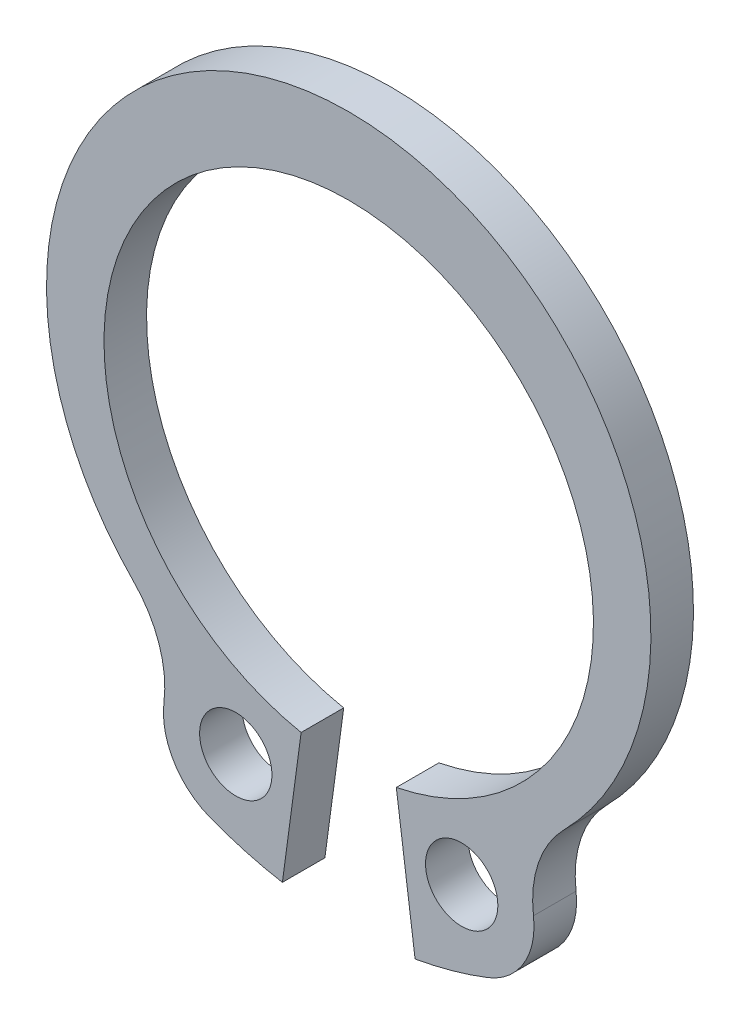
ISO-10303-21;
HEADER;
FILE_DESCRIPTION(('STEP AP214'),'2;1');
FILE_NAME('part.step','',(''),(''),'','','');
FILE_SCHEMA(('AUTOMOTIVE_DESIGN { 1 0 10303 214 1 1 1 1 }'));
ENDSEC;
DATA;
#1=APPLICATION_CONTEXT('core data for automotive mechanical design processes');
#2=APPLICATION_PROTOCOL_DEFINITION('international standard','automotive_design',2000,#1);
#3=PRODUCT_CONTEXT('',#1,'mechanical');
#4=PRODUCT('Part','Part','',(#3));
#5=PRODUCT_RELATED_PRODUCT_CATEGORY('part','',(#4));
#6=PRODUCT_DEFINITION_FORMATION('','',#4);
#7=PRODUCT_DEFINITION_CONTEXT('part definition',#1,'design');
#8=PRODUCT_DEFINITION('design','',#6,#7);
#9=PRODUCT_DEFINITION_SHAPE('','',#8);
#10=(LENGTH_UNIT() NAMED_UNIT(*) SI_UNIT(.MILLI.,.METRE.));
#11=(NAMED_UNIT(*) PLANE_ANGLE_UNIT() SI_UNIT($,.RADIAN.));
#12=(NAMED_UNIT(*) SI_UNIT($,.STERADIAN.) SOLID_ANGLE_UNIT());
#13=UNCERTAINTY_MEASURE_WITH_UNIT(LENGTH_MEASURE(1.E-05),#10,'distance_accuracy_value','');
#14=(GEOMETRIC_REPRESENTATION_CONTEXT(3) GLOBAL_UNCERTAINTY_ASSIGNED_CONTEXT((#13)) GLOBAL_UNIT_ASSIGNED_CONTEXT((#10,
#11,#12)) REPRESENTATION_CONTEXT('',''));
#15=CARTESIAN_POINT('',(0.,0.,0.));
#16=DIRECTION('',(0.,0.,1.));
#17=DIRECTION('',(1.,0.,0.));
#18=AXIS2_PLACEMENT_3D('',#15,#16,#17);
#19=CARTESIAN_POINT('',(0.,0.,1.));
#20=DIRECTION('',(0.,0.,1.));
#21=DIRECTION('',(1.,0.,0.));
#22=AXIS2_PLACEMENT_3D('',#19,#20,#21);
#23=PLANE('',#22);
#24=CARTESIAN_POINT('',(-2.65368608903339,-6.84992738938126,1.));
#25=DIRECTION('',(0.,0.,1.));
#26=DIRECTION('',(-1.,0.,0.));
#27=AXIS2_PLACEMENT_3D('',#24,#25,#26);
#28=CIRCLE('',#27,0.85);
#29=CARTESIAN_POINT('',(-3.50368608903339,-6.84992738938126,1.));
#30=VERTEX_POINT('',#29);
#31=EDGE_CURVE('E127',#30,#30,#28,.T.);
#32=ORIENTED_EDGE('',*,*,#31,.F.);
#33=EDGE_LOOP('',(#32));
#34=FACE_BOUND('',#33,.T.);
#35=CARTESIAN_POINT('',(0.,0.,1.));
#36=DIRECTION('',(0.,0.,-1.));
#37=DIRECTION('',(1.,0.,0.));
#38=AXIS2_PLACEMENT_3D('',#35,#36,#37);
#39=CIRCLE('',#38,5.75);
#40=CARTESIAN_POINT('',(-1.11843961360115,-5.64017666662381,1.));
#41=VERTEX_POINT('',#40);
#42=CARTESIAN_POINT('',(1.11843961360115,-5.64017666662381,1.));
#43=VERTEX_POINT('',#42);
#44=EDGE_CURVE('E149',#41,#43,#39,.T.);
#45=ORIENTED_EDGE('',*,*,#44,.T.);
#46=DIRECTION('',(0.133501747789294,-0.991048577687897,0.));
#47=VECTOR('',#46,1.);
#48=CARTESIAN_POINT('',(1.11843961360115,-5.64017666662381,1.));
#49=LINE('',#48,#47);
#50=CARTESIAN_POINT('',(1.55899538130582,-8.91063697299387,1.));
#51=VERTEX_POINT('',#50);
#52=EDGE_CURVE('E122',#43,#51,#49,.T.);
#53=ORIENTED_EDGE('',*,*,#52,.T.);
#54=CARTESIAN_POINT('',(0.,0.,1.));
#55=DIRECTION('',(0.,0.,1.));
#56=DIRECTION('',(1.,0.,0.));
#57=AXIS2_PLACEMENT_3D('',#54,#55,#56);
#58=CIRCLE('',#57,9.04598904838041);
#59=CARTESIAN_POINT('',(3.26779895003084,-8.43512939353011,1.));
#60=VERTEX_POINT('',#59);
#61=EDGE_CURVE('E152',#51,#60,#58,.T.);
#62=ORIENTED_EDGE('',*,*,#61,.T.);
#63=CARTESIAN_POINT('',(2.65368608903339,-6.84992738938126,1.));
#64=DIRECTION('',(0.,0.,1.));
#65=DIRECTION('',(1.,0.,0.));
#66=AXIS2_PLACEMENT_3D('',#63,#64,#65);
#67=CIRCLE('',#66,1.7);
#68=CARTESIAN_POINT('',(4.34069943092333,-6.64019903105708,1.));
#69=VERTEX_POINT('',#68);
#70=EDGE_CURVE('E154',#60,#69,#67,.T.);
#71=ORIENTED_EDGE('',*,*,#70,.T.);
#72=CARTESIAN_POINT('',(6.87121944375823,-6.32560649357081,1.));
#73=DIRECTION('',(0.,0.,-1.));
#74=DIRECTION('',(1.,0.,0.));
#75=AXIS2_PLACEMENT_3D('',#72,#73,#74);
#76=CIRCLE('',#75,2.55);
#77=CARTESIAN_POINT('',(5.05550860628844,-4.53516125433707,1.));
#78=VERTEX_POINT('',#77);
#79=EDGE_CURVE('E156',#69,#78,#76,.T.);
#80=ORIENTED_EDGE('',*,*,#79,.T.);
#81=CARTESIAN_POINT('',(0.,0.45,1.));
#82=DIRECTION('',(0.,0.,1.));
#83=DIRECTION('',(1.,0.,0.));
#84=AXIS2_PLACEMENT_3D('',#81,#82,#83);
#85=CIRCLE('',#84,7.1);
#86=CARTESIAN_POINT('',(-5.05550860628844,-4.53516125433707,1.));
#87=VERTEX_POINT('',#86);
#88=EDGE_CURVE('E158',#78,#87,#85,.T.);
#89=ORIENTED_EDGE('',*,*,#88,.T.);
#90=CARTESIAN_POINT('',(-6.87121944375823,-6.32560649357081,1.));
#91=DIRECTION('',(0.,0.,-1.));
#92=DIRECTION('',(-1.,0.,0.));
#93=AXIS2_PLACEMENT_3D('',#90,#91,#92);
#94=CIRCLE('',#93,2.55);
#95=CARTESIAN_POINT('',(-4.34069943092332,-6.64019903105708,1.));
#96=VERTEX_POINT('',#95);
#97=EDGE_CURVE('E160',#87,#96,#94,.T.);
#98=ORIENTED_EDGE('',*,*,#97,.T.);
#99=CARTESIAN_POINT('',(-2.65368608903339,-6.84992738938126,1.));
#100=DIRECTION('',(0.,0.,1.));
#101=DIRECTION('',(-1.,0.,0.));
#102=AXIS2_PLACEMENT_3D('',#99,#100,#101);
#103=CIRCLE('',#102,1.7);
#104=CARTESIAN_POINT('',(-3.26779895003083,-8.43512939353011,1.));
#105=VERTEX_POINT('',#104);
#106=EDGE_CURVE('E162',#96,#105,#103,.T.);
#107=ORIENTED_EDGE('',*,*,#106,.T.);
#108=CARTESIAN_POINT('',(0.,0.,1.));
#109=DIRECTION('',(0.,0.,1.));
#110=DIRECTION('',(-1.,0.,0.));
#111=AXIS2_PLACEMENT_3D('',#108,#109,#110);
#112=CIRCLE('',#111,9.04598904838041);
#113=CARTESIAN_POINT('',(-1.55899538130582,-8.91063697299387,1.));
#114=VERTEX_POINT('',#113);
#115=EDGE_CURVE('E51',#105,#114,#112,.T.);
#116=ORIENTED_EDGE('',*,*,#115,.T.);
#117=DIRECTION('',(0.133501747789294,0.991048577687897,0.));
#118=VECTOR('',#117,1.);
#119=CARTESIAN_POINT('',(-1.11843961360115,-5.64017666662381,1.));
#120=LINE('',#119,#118);
#121=EDGE_CURVE('E46',#114,#41,#120,.T.);
#122=ORIENTED_EDGE('',*,*,#121,.T.);
#123=EDGE_LOOP('',(#45,#53,#62,#71,#80,#89,#98,#107,#116,#122));
#124=FACE_BOUND('',#123,.T.);
#125=CARTESIAN_POINT('',(2.65368608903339,-6.84992738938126,1.));
#126=DIRECTION('',(0.,0.,1.));
#127=DIRECTION('',(1.,0.,0.));
#128=AXIS2_PLACEMENT_3D('',#125,#126,#127);
#129=CIRCLE('',#128,0.85);
#130=CARTESIAN_POINT('',(3.50368608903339,-6.84992738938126,1.));
#131=VERTEX_POINT('',#130);
#132=EDGE_CURVE('E249',#131,#131,#129,.T.);
#133=ORIENTED_EDGE('',*,*,#132,.F.);
#134=EDGE_LOOP('',(#133));
#135=FACE_BOUND('',#134,.T.);
#136=ADVANCED_FACE('F31',(#34,#124,#135),#23,.T.);
#137=CARTESIAN_POINT('',(0.,0.,0.));
#138=DIRECTION('',(0.,0.,1.));
#139=DIRECTION('',(1.,0.,0.));
#140=AXIS2_PLACEMENT_3D('',#137,#138,#139);
#141=PLANE('',#140);
#142=CARTESIAN_POINT('',(-2.65368608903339,-6.84992738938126,0.));
#143=DIRECTION('',(0.,0.,1.));
#144=DIRECTION('',(-1.,0.,0.));
#145=AXIS2_PLACEMENT_3D('',#142,#143,#144);
#146=CIRCLE('',#145,0.85);
#147=CARTESIAN_POINT('',(-3.50368608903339,-6.84992738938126,0.));
#148=VERTEX_POINT('',#147);
#149=EDGE_CURVE('E130',#148,#148,#146,.T.);
#150=ORIENTED_EDGE('',*,*,#149,.T.);
#151=EDGE_LOOP('',(#150));
#152=FACE_BOUND('',#151,.T.);
#153=CARTESIAN_POINT('',(0.,0.,0.));
#154=DIRECTION('',(0.,0.,-1.));
#155=DIRECTION('',(1.,0.,0.));
#156=AXIS2_PLACEMENT_3D('',#153,#154,#155);
#157=CIRCLE('',#156,5.75);
#158=CARTESIAN_POINT('',(-1.11843961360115,-5.64017666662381,0.));
#159=VERTEX_POINT('',#158);
#160=CARTESIAN_POINT('',(1.11843961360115,-5.64017666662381,0.));
#161=VERTEX_POINT('',#160);
#162=EDGE_CURVE('E113',#159,#161,#157,.T.);
#163=ORIENTED_EDGE('',*,*,#162,.F.);
#164=DIRECTION('',(0.133501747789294,0.991048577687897,0.));
#165=VECTOR('',#164,1.);
#166=CARTESIAN_POINT('',(-1.11843961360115,-5.64017666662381,0.));
#167=LINE('',#166,#165);
#168=CARTESIAN_POINT('',(-1.55899538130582,-8.91063697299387,0.));
#169=VERTEX_POINT('',#168);
#170=EDGE_CURVE('E147',#169,#159,#167,.T.);
#171=ORIENTED_EDGE('',*,*,#170,.F.);
#172=CARTESIAN_POINT('',(0.,0.,0.));
#173=DIRECTION('',(0.,0.,1.));
#174=DIRECTION('',(-1.,0.,0.));
#175=AXIS2_PLACEMENT_3D('',#172,#173,#174);
#176=CIRCLE('',#175,9.04598904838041);
#177=CARTESIAN_POINT('',(-3.26779895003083,-8.43512939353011,0.));
#178=VERTEX_POINT('',#177);
#179=EDGE_CURVE('E145',#178,#169,#176,.T.);
#180=ORIENTED_EDGE('',*,*,#179,.F.);
#181=CARTESIAN_POINT('',(-2.65368608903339,-6.84992738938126,0.));
#182=DIRECTION('',(0.,0.,1.));
#183=DIRECTION('',(-1.,0.,0.));
#184=AXIS2_PLACEMENT_3D('',#181,#182,#183);
#185=CIRCLE('',#184,1.7);
#186=CARTESIAN_POINT('',(-4.34069943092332,-6.64019903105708,0.));
#187=VERTEX_POINT('',#186);
#188=EDGE_CURVE('E143',#187,#178,#185,.T.);
#189=ORIENTED_EDGE('',*,*,#188,.F.);
#190=CARTESIAN_POINT('',(-6.87121944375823,-6.32560649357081,0.));
#191=DIRECTION('',(0.,0.,-1.));
#192=DIRECTION('',(-1.,0.,0.));
#193=AXIS2_PLACEMENT_3D('',#190,#191,#192);
#194=CIRCLE('',#193,2.55);
#195=CARTESIAN_POINT('',(-5.05550860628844,-4.53516125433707,0.));
#196=VERTEX_POINT('',#195);
#197=EDGE_CURVE('E141',#196,#187,#194,.T.);
#198=ORIENTED_EDGE('',*,*,#197,.F.);
#199=CARTESIAN_POINT('',(0.,0.45,0.));
#200=DIRECTION('',(0.,0.,1.));
#201=DIRECTION('',(1.,0.,0.));
#202=AXIS2_PLACEMENT_3D('',#199,#200,#201);
#203=CIRCLE('',#202,7.1);
#204=CARTESIAN_POINT('',(5.05550860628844,-4.53516125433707,0.));
#205=VERTEX_POINT('',#204);
#206=EDGE_CURVE('E139',#205,#196,#203,.T.);
#207=ORIENTED_EDGE('',*,*,#206,.F.);
#208=CARTESIAN_POINT('',(6.87121944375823,-6.32560649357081,0.));
#209=DIRECTION('',(0.,0.,-1.));
#210=DIRECTION('',(1.,0.,0.));
#211=AXIS2_PLACEMENT_3D('',#208,#209,#210);
#212=CIRCLE('',#211,2.55);
#213=CARTESIAN_POINT('',(4.34069943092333,-6.64019903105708,0.));
#214=VERTEX_POINT('',#213);
#215=EDGE_CURVE('E137',#214,#205,#212,.T.);
#216=ORIENTED_EDGE('',*,*,#215,.F.);
#217=CARTESIAN_POINT('',(2.65368608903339,-6.84992738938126,0.));
#218=DIRECTION('',(0.,0.,1.));
#219=DIRECTION('',(1.,0.,0.));
#220=AXIS2_PLACEMENT_3D('',#217,#218,#219);
#221=CIRCLE('',#220,1.7);
#222=CARTESIAN_POINT('',(3.26779895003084,-8.43512939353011,0.));
#223=VERTEX_POINT('',#222);
#224=EDGE_CURVE('E135',#223,#214,#221,.T.);
#225=ORIENTED_EDGE('',*,*,#224,.F.);
#226=CARTESIAN_POINT('',(0.,0.,0.));
#227=DIRECTION('',(0.,0.,1.));
#228=DIRECTION('',(1.,0.,0.));
#229=AXIS2_PLACEMENT_3D('',#226,#227,#228);
#230=CIRCLE('',#229,9.04598904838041);
#231=CARTESIAN_POINT('',(1.55899538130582,-8.91063697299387,0.));
#232=VERTEX_POINT('',#231);
#233=EDGE_CURVE('E115',#232,#223,#230,.T.);
#234=ORIENTED_EDGE('',*,*,#233,.F.);
#235=DIRECTION('',(0.133501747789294,-0.991048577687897,0.));
#236=VECTOR('',#235,1.);
#237=CARTESIAN_POINT('',(1.11843961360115,-5.64017666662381,0.));
#238=LINE('',#237,#236);
#239=EDGE_CURVE('E108',#161,#232,#238,.T.);
#240=ORIENTED_EDGE('',*,*,#239,.F.);
#241=EDGE_LOOP('',(#163,#171,#180,#189,#198,#207,#216,#225,#234,#240));
#242=FACE_BOUND('',#241,.T.);
#243=CARTESIAN_POINT('',(2.65368608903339,-6.84992738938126,0.));
#244=DIRECTION('',(0.,0.,1.));
#245=DIRECTION('',(1.,0.,0.));
#246=AXIS2_PLACEMENT_3D('',#243,#244,#245);
#247=CIRCLE('',#246,0.85);
#248=CARTESIAN_POINT('',(3.50368608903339,-6.84992738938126,0.));
#249=VERTEX_POINT('',#248);
#250=EDGE_CURVE('E252',#249,#249,#247,.T.);
#251=ORIENTED_EDGE('',*,*,#250,.T.);
#252=EDGE_LOOP('',(#251));
#253=FACE_BOUND('',#252,.T.);
#254=ADVANCED_FACE('F109',(#152,#242,#253),#141,.F.);
#255=CARTESIAN_POINT('',(0.,0.,1.));
#256=DIRECTION('',(0.,0.,-1.));
#257=DIRECTION('',(-1.,0.,0.));
#258=AXIS2_PLACEMENT_3D('',#255,#256,#257);
#259=CYLINDRICAL_SURFACE('',#258,5.75);
#260=ORIENTED_EDGE('',*,*,#162,.T.);
#261=DIRECTION('',(0.,0.,-1.));
#262=VECTOR('',#261,1.);
#263=CARTESIAN_POINT('',(1.11843961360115,-5.64017666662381,1.));
#264=LINE('',#263,#262);
#265=EDGE_CURVE('E11',#43,#161,#264,.T.);
#266=ORIENTED_EDGE('',*,*,#265,.F.);
#267=ORIENTED_EDGE('',*,*,#44,.F.);
#268=DIRECTION('',(0.,0.,-1.));
#269=VECTOR('',#268,1.);
#270=CARTESIAN_POINT('',(-1.11843961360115,-5.64017666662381,1.));
#271=LINE('',#270,#269);
#272=EDGE_CURVE('E126',#41,#159,#271,.T.);
#273=ORIENTED_EDGE('',*,*,#272,.T.);
#274=EDGE_LOOP('',(#260,#266,#267,#273));
#275=FACE_BOUND('',#274,.T.);
#276=ADVANCED_FACE('F33',(#275),#259,.F.);
#277=CARTESIAN_POINT('',(1.11843961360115,-5.64017666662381,1.));
#278=DIRECTION('',(0.991048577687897,0.133501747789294,0.));
#279=DIRECTION('',(-0.133501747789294,0.991048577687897,0.));
#280=AXIS2_PLACEMENT_3D('',#277,#278,#279);
#281=PLANE('',#280);
#282=ORIENTED_EDGE('',*,*,#239,.T.);
#283=DIRECTION('',(0.,0.,-1.));
#284=VECTOR('',#283,1.);
#285=CARTESIAN_POINT('',(1.55899538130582,-8.91063697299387,1.));
#286=LINE('',#285,#284);
#287=EDGE_CURVE('E39',#51,#232,#286,.T.);
#288=ORIENTED_EDGE('',*,*,#287,.F.);
#289=ORIENTED_EDGE('',*,*,#52,.F.);
#290=ORIENTED_EDGE('',*,*,#265,.T.);
#291=EDGE_LOOP('',(#282,#288,#289,#290));
#292=FACE_BOUND('',#291,.T.);
#293=ADVANCED_FACE('F121',(#292),#281,.F.);
#294=CARTESIAN_POINT('',(0.,0.,1.));
#295=DIRECTION('',(0.,0.,-1.));
#296=DIRECTION('',(-1.,0.,0.));
#297=AXIS2_PLACEMENT_3D('',#294,#295,#296);
#298=CYLINDRICAL_SURFACE('',#297,9.04598904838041);
#299=ORIENTED_EDGE('',*,*,#233,.T.);
#300=DIRECTION('',(0.,0.,-1.));
#301=VECTOR('',#300,1.);
#302=CARTESIAN_POINT('',(3.26779895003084,-8.43512939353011,1.));
#303=LINE('',#302,#301);
#304=EDGE_CURVE('E185',#60,#223,#303,.T.);
#305=ORIENTED_EDGE('',*,*,#304,.F.);
#306=ORIENTED_EDGE('',*,*,#61,.F.);
#307=ORIENTED_EDGE('',*,*,#287,.T.);
#308=EDGE_LOOP('',(#299,#305,#306,#307));
#309=FACE_BOUND('',#308,.T.);
#310=ADVANCED_FACE('F189',(#309),#298,.T.);
#311=CARTESIAN_POINT('',(2.65368608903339,-6.84992738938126,1.));
#312=DIRECTION('',(0.,0.,-1.));
#313=DIRECTION('',(-1.,0.,0.));
#314=AXIS2_PLACEMENT_3D('',#311,#312,#313);
#315=CYLINDRICAL_SURFACE('',#314,1.7);
#316=ORIENTED_EDGE('',*,*,#224,.T.);
#317=DIRECTION('',(0.,0.,-1.));
#318=VECTOR('',#317,1.);
#319=CARTESIAN_POINT('',(4.34069943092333,-6.64019903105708,1.));
#320=LINE('',#319,#318);
#321=EDGE_CURVE('E182',#69,#214,#320,.T.);
#322=ORIENTED_EDGE('',*,*,#321,.F.);
#323=ORIENTED_EDGE('',*,*,#70,.F.);
#324=ORIENTED_EDGE('',*,*,#304,.T.);
#325=EDGE_LOOP('',(#316,#322,#323,#324));
#326=FACE_BOUND('',#325,.T.);
#327=ADVANCED_FACE('F197',(#326),#315,.T.);
#328=CARTESIAN_POINT('',(6.87121944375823,-6.32560649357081,1.));
#329=DIRECTION('',(0.,0.,-1.));
#330=DIRECTION('',(-1.,0.,0.));
#331=AXIS2_PLACEMENT_3D('',#328,#329,#330);
#332=CYLINDRICAL_SURFACE('',#331,2.55);
#333=ORIENTED_EDGE('',*,*,#215,.T.);
#334=DIRECTION('',(0.,0.,-1.));
#335=VECTOR('',#334,1.);
#336=CARTESIAN_POINT('',(5.05550860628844,-4.53516125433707,1.));
#337=LINE('',#336,#335);
#338=EDGE_CURVE('E179',#78,#205,#337,.T.);
#339=ORIENTED_EDGE('',*,*,#338,.F.);
#340=ORIENTED_EDGE('',*,*,#79,.F.);
#341=ORIENTED_EDGE('',*,*,#321,.T.);
#342=EDGE_LOOP('',(#333,#339,#340,#341));
#343=FACE_BOUND('',#342,.T.);
#344=ADVANCED_FACE('F200',(#343),#332,.F.);
#345=CARTESIAN_POINT('',(0.,0.45,1.));
#346=DIRECTION('',(0.,0.,-1.));
#347=DIRECTION('',(-1.,0.,0.));
#348=AXIS2_PLACEMENT_3D('',#345,#346,#347);
#349=CYLINDRICAL_SURFACE('',#348,7.1);
#350=ORIENTED_EDGE('',*,*,#206,.T.);
#351=DIRECTION('',(0.,0.,-1.));
#352=VECTOR('',#351,1.);
#353=CARTESIAN_POINT('',(-5.05550860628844,-4.53516125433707,1.));
#354=LINE('',#353,#352);
#355=EDGE_CURVE('E176',#87,#196,#354,.T.);
#356=ORIENTED_EDGE('',*,*,#355,.F.);
#357=ORIENTED_EDGE('',*,*,#88,.F.);
#358=ORIENTED_EDGE('',*,*,#338,.T.);
#359=EDGE_LOOP('',(#350,#356,#357,#358));
#360=FACE_BOUND('',#359,.T.);
#361=ADVANCED_FACE('F205',(#360),#349,.T.);
#362=CARTESIAN_POINT('',(-6.87121944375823,-6.32560649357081,1.));
#363=DIRECTION('',(0.,0.,-1.));
#364=DIRECTION('',(-1.,0.,0.));
#365=AXIS2_PLACEMENT_3D('',#362,#363,#364);
#366=CYLINDRICAL_SURFACE('',#365,2.55);
#367=ORIENTED_EDGE('',*,*,#197,.T.);
#368=DIRECTION('',(0.,0.,-1.));
#369=VECTOR('',#368,1.);
#370=CARTESIAN_POINT('',(-4.34069943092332,-6.64019903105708,1.));
#371=LINE('',#370,#369);
#372=EDGE_CURVE('E173',#96,#187,#371,.T.);
#373=ORIENTED_EDGE('',*,*,#372,.F.);
#374=ORIENTED_EDGE('',*,*,#97,.F.);
#375=ORIENTED_EDGE('',*,*,#355,.T.);
#376=EDGE_LOOP('',(#367,#373,#374,#375));
#377=FACE_BOUND('',#376,.T.);
#378=ADVANCED_FACE('F211',(#377),#366,.F.);
#379=CARTESIAN_POINT('',(-2.65368608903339,-6.84992738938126,1.));
#380=DIRECTION('',(0.,0.,-1.));
#381=DIRECTION('',(-1.,0.,0.));
#382=AXIS2_PLACEMENT_3D('',#379,#380,#381);
#383=CYLINDRICAL_SURFACE('',#382,1.7);
#384=ORIENTED_EDGE('',*,*,#188,.T.);
#385=DIRECTION('',(0.,0.,-1.));
#386=VECTOR('',#385,1.);
#387=CARTESIAN_POINT('',(-3.26779895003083,-8.43512939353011,1.));
#388=LINE('',#387,#386);
#389=EDGE_CURVE('E170',#105,#178,#388,.T.);
#390=ORIENTED_EDGE('',*,*,#389,.F.);
#391=ORIENTED_EDGE('',*,*,#106,.F.);
#392=ORIENTED_EDGE('',*,*,#372,.T.);
#393=EDGE_LOOP('',(#384,#390,#391,#392));
#394=FACE_BOUND('',#393,.T.);
#395=ADVANCED_FACE('F215',(#394),#383,.T.);
#396=CARTESIAN_POINT('',(0.,0.,1.));
#397=DIRECTION('',(0.,0.,-1.));
#398=DIRECTION('',(-1.,0.,0.));
#399=AXIS2_PLACEMENT_3D('',#396,#397,#398);
#400=CYLINDRICAL_SURFACE('',#399,9.04598904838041);
#401=ORIENTED_EDGE('',*,*,#179,.T.);
#402=DIRECTION('',(0.,0.,-1.));
#403=VECTOR('',#402,1.);
#404=CARTESIAN_POINT('',(-1.55899538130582,-8.91063697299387,1.));
#405=LINE('',#404,#403);
#406=EDGE_CURVE('E167',#114,#169,#405,.T.);
#407=ORIENTED_EDGE('',*,*,#406,.F.);
#408=ORIENTED_EDGE('',*,*,#115,.F.);
#409=ORIENTED_EDGE('',*,*,#389,.T.);
#410=EDGE_LOOP('',(#401,#407,#408,#409));
#411=FACE_BOUND('',#410,.T.);
#412=ADVANCED_FACE('F218',(#411),#400,.T.);
#413=CARTESIAN_POINT('',(-1.11843961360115,-5.64017666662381,1.));
#414=DIRECTION('',(-0.991048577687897,0.133501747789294,0.));
#415=DIRECTION('',(-0.133501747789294,-0.991048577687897,0.));
#416=AXIS2_PLACEMENT_3D('',#413,#414,#415);
#417=PLANE('',#416);
#418=ORIENTED_EDGE('',*,*,#170,.T.);
#419=ORIENTED_EDGE('',*,*,#272,.F.);
#420=ORIENTED_EDGE('',*,*,#121,.F.);
#421=ORIENTED_EDGE('',*,*,#406,.T.);
#422=EDGE_LOOP('',(#418,#419,#420,#421));
#423=FACE_BOUND('',#422,.T.);
#424=ADVANCED_FACE('F220',(#423),#417,.F.);
#425=CARTESIAN_POINT('',(-2.65368608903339,-6.84992738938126,1.));
#426=DIRECTION('',(0.,0.,-1.));
#427=DIRECTION('',(-1.,0.,0.));
#428=AXIS2_PLACEMENT_3D('',#425,#426,#427);
#429=CYLINDRICAL_SURFACE('',#428,0.85);
#430=ORIENTED_EDGE('',*,*,#31,.T.);
#431=EDGE_LOOP('',(#430));
#432=FACE_BOUND('',#431,.T.);
#433=ORIENTED_EDGE('',*,*,#149,.F.);
#434=EDGE_LOOP('',(#433));
#435=FACE_BOUND('',#434,.T.);
#436=ADVANCED_FACE('F222',(#432,#435),#429,.F.);
#437=CARTESIAN_POINT('',(2.65368608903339,-6.84992738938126,1.));
#438=DIRECTION('',(0.,0.,-1.));
#439=DIRECTION('',(-1.,0.,0.));
#440=AXIS2_PLACEMENT_3D('',#437,#438,#439);
#441=CYLINDRICAL_SURFACE('',#440,0.85);
#442=ORIENTED_EDGE('',*,*,#132,.T.);
#443=EDGE_LOOP('',(#442));
#444=FACE_BOUND('',#443,.T.);
#445=ORIENTED_EDGE('',*,*,#250,.F.);
#446=EDGE_LOOP('',(#445));
#447=FACE_BOUND('',#446,.T.);
#448=ADVANCED_FACE('F228',(#444,#447),#441,.F.);
#449=CLOSED_SHELL('',(#136,#254,#276,#293,#310,#327,#344,#361,#378,#395,#412,#424,#436,#448));
#450=MANIFOLD_SOLID_BREP('B2',#449);
#451=ADVANCED_BREP_SHAPE_REPRESENTATION('',(#18,#450),#14);
#452=SHAPE_DEFINITION_REPRESENTATION(#9,#451);
ENDSEC;
END-ISO-10303-21;
